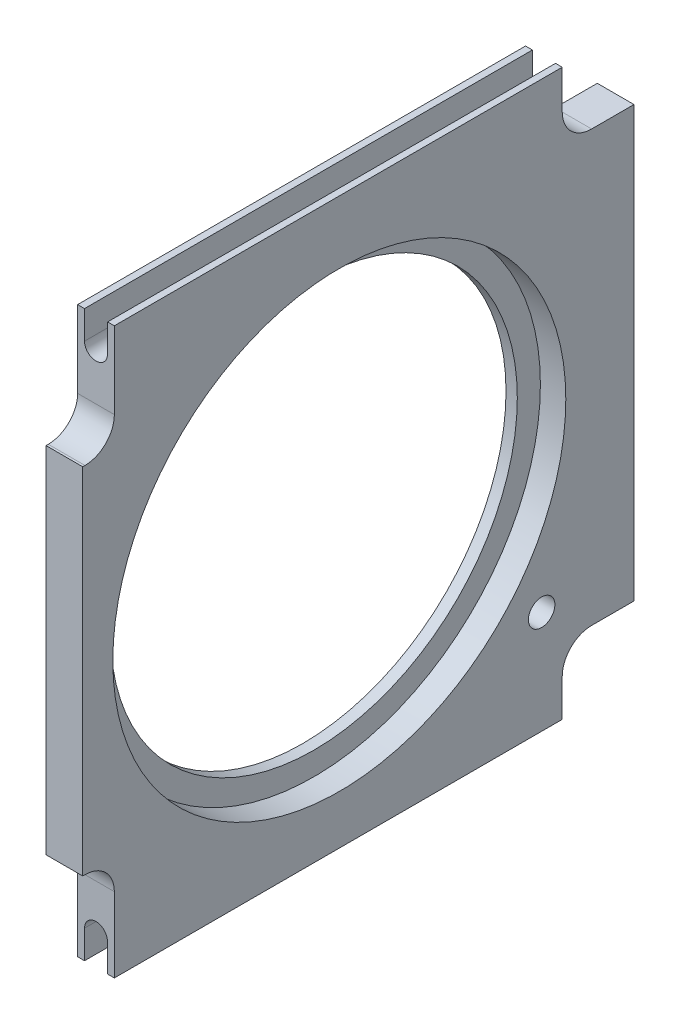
from build123d import *

# Parameters (mm, degrees)
SKETCH1_R                   = 45.737635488
SKETCH1_R_2                 = 2.976435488
PART_OUTLINE_DEPTH          = 8.255
COW_PADDY_CUTOUT_DEPTH      = 25.4
COW_PADDY_CUTOUT_DEPTH_BACK = 5.715
SKETCH2_R                   = 50.927
BOLT_SLOTS_DEPTH            = 141.22850275
BOLT_COUNTERSINKS_DEPTH     = 94.220463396


with BuildPart() as part:
    # Sketch1 → Part outline (new body)
    with BuildSketch(Plane(origin=(0, 0, 0), x_dir=(0, 0, -1), z_dir=(1, 0, 0))):
        with BuildLine():
            Line((66.25798153, 65.052207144), (66.25798153, -61.947792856))
            Line((66.25798153, -61.947792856), (-50.58201847, -61.947792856))
            Line((-50.58201847, -61.947792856), (-50.58201847, -45.132589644))
            ThreePointArc((-50.58201847, -45.132589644), (-52.516285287, -40.462856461), (-57.18601847, -38.528589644))
            Line((-57.18601847, -38.528589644), (-57.69401847, -38.528589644))
            Line((-57.69401847, -38.528589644), (-57.69401847, 41.157154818))
            Line((-57.69401847, 41.157154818), (-57.18601847, 41.157154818))
            ThreePointArc((-57.18601847, 41.157154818), (-52.516285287, 43.091421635), (-50.58201847, 47.761154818))
            Line((-50.58201847, 47.761154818), (-50.58201847, 65.052207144))
            Line((-50.58201847, 65.052207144), (66.25798153, 65.052207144))
        make_face()
        Circle(SKETCH1_R, mode=Mode.SUBTRACT)
        with Locations((45.48892701, -38.761967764)):
            Circle(SKETCH1_R_2, mode=Mode.SUBTRACT)
    extrude(amount=PART_OUTLINE_DEPTH)

    # Sketch2 → Cow paddy cutout (cut, two sides: drawn at the far end of the back side and taken through both)
    with BuildSketch(Plane(origin=(8.255, 0, 0), x_dir=(0, 0, -1), z_dir=(1, 0, 0)).offset(-COW_PADDY_CUTOUT_DEPTH_BACK)):
        Circle(SKETCH2_R)
    extrude(amount=COW_PADDY_CUTOUT_DEPTH + COW_PADDY_CUTOUT_DEPTH_BACK, mode=Mode.SUBTRACT)

    # Sketch3 → Bolt slots (cut, through all)
    with BuildSketch(Plane(origin=(0, 0, -66.25798153), x_dir=(-1, 0, 0), z_dir=(0, 0, -1))):
        with BuildLine():
            Line((-1.547812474, 58.702207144), (-1.547812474, 68.603705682))
            Line((-1.547812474, 68.603705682), (-6.762687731, 68.603705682))
            Line((-6.762687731, 68.603705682), (-6.707051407, 58.728702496))
            ThreePointArc((-6.707051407, 58.728702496), (-4.140747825, 56.122553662), (-1.547812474, 58.702207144))
        make_face()
        with BuildLine():
            Line((-1.547812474, -55.597792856), (-1.547812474, -67.236004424))
            Line((-1.547812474, -67.236004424), (-6.707187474, -67.236004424))
            Line((-6.707187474, -67.236004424), (-6.707187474, -55.597792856))
            ThreePointArc((-6.707187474, -55.597792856), (-4.127499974, -53.018105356), (-1.547812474, -55.597792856))
        make_face()
    extrude(amount=-BOLT_SLOTS_DEPTH, mode=Mode.SUBTRACT)

    # Sketch4 → Bolt countersinks (cut, through all)
    with BuildSketch(Plane(origin=(8.255, 0, 0), x_dir=(0, 0, -1), z_dir=(1, 0, 0))):
        with BuildLine():
            Line((56.727042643, 49.721154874), (73.406532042, 49.721154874))
            Line((73.406532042, 49.721154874), (73.406532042, 71.519152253))
            Line((73.406532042, 71.519152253), (50.123042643, 71.519152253))
            Line((50.123042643, 71.519152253), (50.123042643, 56.325154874))
            ThreePointArc((50.123042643, 56.325154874), (52.05730946, 51.655421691), (56.727042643, 49.721154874))
        make_face()
        with BuildLine():
            Line((50.123042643, -77.442262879), (73.406532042, -77.442262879))
            Line((73.406532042, -77.442262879), (73.406532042, -46.957438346))
            Line((73.406532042, -46.957438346), (56.727042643, -46.957438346))
            ThreePointArc((56.727042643, -46.957438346), (52.05730946, -48.891705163), (50.123042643, -53.561438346))
            Line((50.123042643, -53.561438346), (50.123042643, -77.442262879))
        make_face()
    extrude(amount=-BOLT_COUNTERSINKS_DEPTH, mode=Mode.SUBTRACT)


solid = part.part
